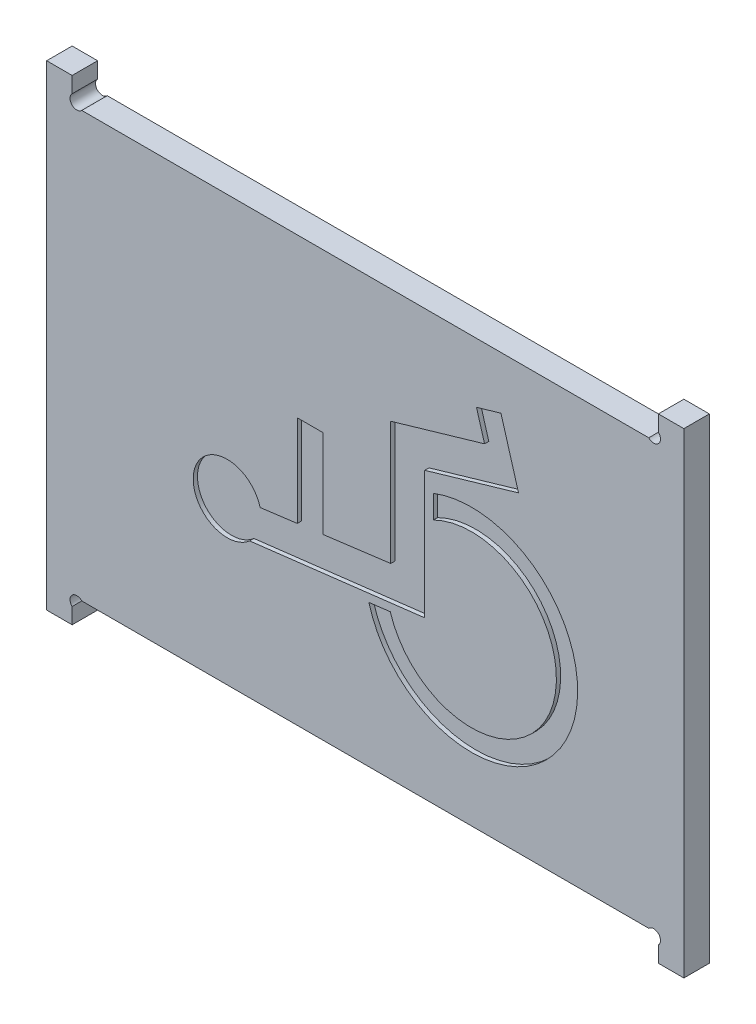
ISO-10303-21;
HEADER;
FILE_DESCRIPTION(('STEP AP214'),'2;1');
FILE_NAME('part.step','',(''),(''),'','','');
FILE_SCHEMA(('AUTOMOTIVE_DESIGN { 1 0 10303 214 1 1 1 1 }'));
ENDSEC;
DATA;
#1=APPLICATION_CONTEXT('core data for automotive mechanical design processes');
#2=APPLICATION_PROTOCOL_DEFINITION('international standard','automotive_design',2000,#1);
#3=PRODUCT_CONTEXT('',#1,'mechanical');
#4=PRODUCT('Part','Part','',(#3));
#5=PRODUCT_RELATED_PRODUCT_CATEGORY('part','',(#4));
#6=PRODUCT_DEFINITION_FORMATION('','',#4);
#7=PRODUCT_DEFINITION_CONTEXT('part definition',#1,'design');
#8=PRODUCT_DEFINITION('design','',#6,#7);
#9=PRODUCT_DEFINITION_SHAPE('','',#8);
#10=(LENGTH_UNIT() NAMED_UNIT(*) SI_UNIT(.MILLI.,.METRE.));
#11=(NAMED_UNIT(*) PLANE_ANGLE_UNIT() SI_UNIT($,.RADIAN.));
#12=(NAMED_UNIT(*) SI_UNIT($,.STERADIAN.) SOLID_ANGLE_UNIT());
#13=UNCERTAINTY_MEASURE_WITH_UNIT(LENGTH_MEASURE(1.E-05),#10,'distance_accuracy_value','');
#14=(GEOMETRIC_REPRESENTATION_CONTEXT(3) GLOBAL_UNCERTAINTY_ASSIGNED_CONTEXT((#13)) GLOBAL_UNIT_ASSIGNED_CONTEXT((#10,
#11,#12)) REPRESENTATION_CONTEXT('',''));
#15=CARTESIAN_POINT('',(0.,0.,0.));
#16=DIRECTION('',(0.,0.,1.));
#17=DIRECTION('',(1.,0.,0.));
#18=AXIS2_PLACEMENT_3D('',#15,#16,#17);
#19=CARTESIAN_POINT('',(-44.2409019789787,-70.5968781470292,6.));
#20=DIRECTION('',(1.,0.,0.));
#21=DIRECTION('',(0.,1.,0.));
#22=AXIS2_PLACEMENT_3D('',#19,#20,#21);
#23=PLANE('',#22);
#24=DIRECTION('',(0.,-1.,0.));
#25=VECTOR('',#24,1.);
#26=CARTESIAN_POINT('',(-44.2409019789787,-70.5968781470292,0.));
#27=LINE('',#26,#25);
#28=CARTESIAN_POINT('',(-44.2409019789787,35.4031218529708,0.));
#29=VERTEX_POINT('',#28);
#30=CARTESIAN_POINT('',(-44.2409019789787,-76.5968781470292,0.));
#31=VERTEX_POINT('',#30);
#32=EDGE_CURVE('E529',#29,#31,#27,.T.);
#33=ORIENTED_EDGE('',*,*,#32,.T.);
#34=DIRECTION('',(0.,0.,-1.));
#35=VECTOR('',#34,1.);
#36=CARTESIAN_POINT('',(-44.2409019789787,-76.5968781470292,6.));
#37=LINE('',#36,#35);
#38=CARTESIAN_POINT('',(-44.2409019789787,-76.5968781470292,6.));
#39=VERTEX_POINT('',#38);
#40=EDGE_CURVE('E327',#39,#31,#37,.T.);
#41=ORIENTED_EDGE('',*,*,#40,.F.);
#42=DIRECTION('',(0.,-1.,0.));
#43=VECTOR('',#42,1.);
#44=CARTESIAN_POINT('',(-44.2409019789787,29.4031218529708,6.));
#45=LINE('',#44,#43);
#46=CARTESIAN_POINT('',(-44.2409019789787,35.4031218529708,6.));
#47=VERTEX_POINT('',#46);
#48=EDGE_CURVE('E275',#47,#39,#45,.T.);
#49=ORIENTED_EDGE('',*,*,#48,.F.);
#50=DIRECTION('',(0.,0.,-1.));
#51=VECTOR('',#50,1.);
#52=CARTESIAN_POINT('',(-44.2409019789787,35.4031218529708,6.));
#53=LINE('',#52,#51);
#54=EDGE_CURVE('E307',#47,#29,#53,.T.);
#55=ORIENTED_EDGE('',*,*,#54,.T.);
#56=EDGE_LOOP('',(#33,#41,#49,#55));
#57=FACE_BOUND('',#56,.T.);
#58=ADVANCED_FACE('F34',(#57),#23,.F.);
#59=CARTESIAN_POINT('',(-44.2409019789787,-76.5968781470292,6.));
#60=DIRECTION('',(0.,1.,0.));
#61=DIRECTION('',(0.,0.,1.));
#62=AXIS2_PLACEMENT_3D('',#59,#60,#61);
#63=PLANE('',#62);
#64=DIRECTION('',(1.,0.,0.));
#65=VECTOR('',#64,1.);
#66=CARTESIAN_POINT('',(-44.2409019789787,-76.5968781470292,0.));
#67=LINE('',#66,#65);
#68=CARTESIAN_POINT('',(-38.2409019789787,-76.5968781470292,0.));
#69=VERTEX_POINT('',#68);
#70=EDGE_CURVE('E537',#31,#69,#67,.T.);
#71=ORIENTED_EDGE('',*,*,#70,.T.);
#72=DIRECTION('',(0.,0.,-1.));
#73=VECTOR('',#72,1.);
#74=CARTESIAN_POINT('',(-38.2409019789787,-76.5968781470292,6.));
#75=LINE('',#74,#73);
#76=CARTESIAN_POINT('',(-38.2409019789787,-76.5968781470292,6.));
#77=VERTEX_POINT('',#76);
#78=EDGE_CURVE('E324',#77,#69,#75,.T.);
#79=ORIENTED_EDGE('',*,*,#78,.F.);
#80=DIRECTION('',(1.,0.,0.));
#81=VECTOR('',#80,1.);
#82=CARTESIAN_POINT('',(-44.2409019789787,-76.5968781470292,6.));
#83=LINE('',#82,#81);
#84=EDGE_CURVE('E282',#39,#77,#83,.T.);
#85=ORIENTED_EDGE('',*,*,#84,.F.);
#86=ORIENTED_EDGE('',*,*,#40,.T.);
#87=EDGE_LOOP('',(#71,#79,#85,#86));
#88=FACE_BOUND('',#87,.T.);
#89=ADVANCED_FACE('F557',(#88),#63,.F.);
#90=CARTESIAN_POINT('',(-38.2409019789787,-76.5968781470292,6.));
#91=DIRECTION('',(-1.,0.,0.));
#92=DIRECTION('',(0.,0.,1.));
#93=AXIS2_PLACEMENT_3D('',#90,#91,#92);
#94=PLANE('',#93);
#95=DIRECTION('',(0.,1.,0.));
#96=VECTOR('',#95,1.);
#97=CARTESIAN_POINT('',(-38.2409019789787,-76.5968781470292,0.));
#98=LINE('',#97,#96);
#99=CARTESIAN_POINT('',(-38.2409019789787,-72.8587731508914,0.));
#100=VERTEX_POINT('',#99);
#101=EDGE_CURVE('E354',#69,#100,#98,.T.);
#102=ORIENTED_EDGE('',*,*,#101,.T.);
#103=DIRECTION('',(0.,0.,1.));
#104=VECTOR('',#103,1.);
#105=CARTESIAN_POINT('',(-38.2409019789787,-72.8587731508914,0.));
#106=LINE('',#105,#104);
#107=CARTESIAN_POINT('',(-38.2409019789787,-72.8587731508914,6.));
#108=VERTEX_POINT('',#107);
#109=EDGE_CURVE('E390',#100,#108,#106,.T.);
#110=ORIENTED_EDGE('',*,*,#109,.T.);
#111=DIRECTION('',(0.,1.,0.));
#112=VECTOR('',#111,1.);
#113=CARTESIAN_POINT('',(-38.2409019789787,-76.5968781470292,6.));
#114=LINE('',#113,#112);
#115=EDGE_CURVE('E284',#77,#108,#114,.T.);
#116=ORIENTED_EDGE('',*,*,#115,.F.);
#117=ORIENTED_EDGE('',*,*,#78,.T.);
#118=EDGE_LOOP('',(#102,#110,#116,#117));
#119=FACE_BOUND('',#118,.T.);
#120=ADVANCED_FACE('F541',(#119),#94,.F.);
#121=CARTESIAN_POINT('',(-38.2409019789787,-70.5968781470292,6.));
#122=DIRECTION('',(0.,1.,0.));
#123=DIRECTION('',(-1.,0.,0.));
#124=AXIS2_PLACEMENT_3D('',#121,#122,#123);
#125=PLANE('',#124);
#126=DIRECTION('',(1.,0.,0.));
#127=VECTOR('',#126,1.);
#128=CARTESIAN_POINT('',(-38.2409019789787,-70.5968781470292,0.));
#129=LINE('',#128,#127);
#130=CARTESIAN_POINT('',(-35.9790069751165,-70.5968781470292,0.));
#131=VERTEX_POINT('',#130);
#132=CARTESIAN_POINT('',(97.4972030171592,-70.5968781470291,0.));
#133=VERTEX_POINT('',#132);
#134=EDGE_CURVE('E350',#131,#133,#129,.T.);
#135=ORIENTED_EDGE('',*,*,#134,.T.);
#136=DIRECTION('',(0.,0.,1.));
#137=VECTOR('',#136,1.);
#138=CARTESIAN_POINT('',(97.4972030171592,-70.5968781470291,0.));
#139=LINE('',#138,#137);
#140=CARTESIAN_POINT('',(97.4972030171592,-70.5968781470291,6.));
#141=VERTEX_POINT('',#140);
#142=EDGE_CURVE('E336',#133,#141,#139,.T.);
#143=ORIENTED_EDGE('',*,*,#142,.T.);
#144=DIRECTION('',(1.,0.,0.));
#145=VECTOR('',#144,1.);
#146=CARTESIAN_POINT('',(-38.2409019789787,-70.5968781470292,6.));
#147=LINE('',#146,#145);
#148=CARTESIAN_POINT('',(-35.9790069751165,-70.5968781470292,6.));
#149=VERTEX_POINT('',#148);
#150=EDGE_CURVE('E287',#149,#141,#147,.T.);
#151=ORIENTED_EDGE('',*,*,#150,.F.);
#152=DIRECTION('',(0.,0.,1.));
#153=VECTOR('',#152,1.);
#154=CARTESIAN_POINT('',(-35.9790069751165,-70.5968781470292,0.));
#155=LINE('',#154,#153);
#156=EDGE_CURVE('E387',#149,#131,#155,.F.);
#157=ORIENTED_EDGE('',*,*,#156,.T.);
#158=EDGE_LOOP('',(#135,#143,#151,#157));
#159=FACE_BOUND('',#158,.T.);
#160=ADVANCED_FACE('F550',(#159),#125,.F.);
#161=CARTESIAN_POINT('',(99.7590980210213,-76.5968781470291,6.));
#162=DIRECTION('',(1.,0.,0.));
#163=DIRECTION('',(0.,1.,0.));
#164=AXIS2_PLACEMENT_3D('',#161,#162,#163);
#165=PLANE('',#164);
#166=DIRECTION('',(0.,-1.,0.));
#167=VECTOR('',#166,1.);
#168=CARTESIAN_POINT('',(99.7590980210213,-76.5968781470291,6.));
#169=LINE('',#168,#167);
#170=CARTESIAN_POINT('',(99.7590980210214,-72.8587731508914,6.));
#171=VERTEX_POINT('',#170);
#172=CARTESIAN_POINT('',(99.7590980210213,-76.5968781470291,6.));
#173=VERTEX_POINT('',#172);
#174=EDGE_CURVE('E290',#171,#173,#169,.T.);
#175=ORIENTED_EDGE('',*,*,#174,.F.);
#176=DIRECTION('',(0.,0.,1.));
#177=VECTOR('',#176,1.);
#178=CARTESIAN_POINT('',(99.7590980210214,-72.8587731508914,0.));
#179=LINE('',#178,#177);
#180=CARTESIAN_POINT('',(99.7590980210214,-72.8587731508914,0.));
#181=VERTEX_POINT('',#180);
#182=EDGE_CURVE('E333',#171,#181,#179,.F.);
#183=ORIENTED_EDGE('',*,*,#182,.T.);
#184=DIRECTION('',(0.,-1.,0.));
#185=VECTOR('',#184,1.);
#186=CARTESIAN_POINT('',(99.7590980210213,-76.5968781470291,0.));
#187=LINE('',#186,#185);
#188=CARTESIAN_POINT('',(99.7590980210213,-76.5968781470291,0.));
#189=VERTEX_POINT('',#188);
#190=EDGE_CURVE('E344',#181,#189,#187,.T.);
#191=ORIENTED_EDGE('',*,*,#190,.T.);
#192=DIRECTION('',(0.,0.,-1.));
#193=VECTOR('',#192,1.);
#194=CARTESIAN_POINT('',(99.7590980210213,-76.5968781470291,6.));
#195=LINE('',#194,#193);
#196=EDGE_CURVE('E321',#173,#189,#195,.T.);
#197=ORIENTED_EDGE('',*,*,#196,.F.);
#198=EDGE_LOOP('',(#175,#183,#191,#197));
#199=FACE_BOUND('',#198,.T.);
#200=ADVANCED_FACE('F342',(#199),#165,.F.);
#201=CARTESIAN_POINT('',(105.759098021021,-76.5968781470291,6.));
#202=DIRECTION('',(0.,1.,0.));
#203=DIRECTION('',(0.,0.,1.));
#204=AXIS2_PLACEMENT_3D('',#201,#202,#203);
#205=PLANE('',#204);
#206=DIRECTION('',(1.,0.,0.));
#207=VECTOR('',#206,1.);
#208=CARTESIAN_POINT('',(105.759098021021,-76.5968781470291,0.));
#209=LINE('',#208,#207);
#210=CARTESIAN_POINT('',(105.759098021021,-76.5968781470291,0.));
#211=VERTEX_POINT('',#210);
#212=EDGE_CURVE('E349',#189,#211,#209,.T.);
#213=ORIENTED_EDGE('',*,*,#212,.T.);
#214=DIRECTION('',(0.,0.,-1.));
#215=VECTOR('',#214,1.);
#216=CARTESIAN_POINT('',(105.759098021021,-76.5968781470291,6.));
#217=LINE('',#216,#215);
#218=CARTESIAN_POINT('',(105.759098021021,-76.5968781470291,6.));
#219=VERTEX_POINT('',#218);
#220=EDGE_CURVE('E318',#219,#211,#217,.T.);
#221=ORIENTED_EDGE('',*,*,#220,.F.);
#222=DIRECTION('',(1.,0.,0.));
#223=VECTOR('',#222,1.);
#224=CARTESIAN_POINT('',(105.759098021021,-76.5968781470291,6.));
#225=LINE('',#224,#223);
#226=EDGE_CURVE('E292',#173,#219,#225,.T.);
#227=ORIENTED_EDGE('',*,*,#226,.F.);
#228=ORIENTED_EDGE('',*,*,#196,.T.);
#229=EDGE_LOOP('',(#213,#221,#227,#228));
#230=FACE_BOUND('',#229,.T.);
#231=ADVANCED_FACE('F573',(#230),#205,.F.);
#232=CARTESIAN_POINT('',(105.759098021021,35.4031218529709,6.));
#233=DIRECTION('',(-1.,0.,0.));
#234=DIRECTION('',(0.,-1.,0.));
#235=AXIS2_PLACEMENT_3D('',#232,#233,#234);
#236=PLANE('',#235);
#237=DIRECTION('',(0.,1.,0.));
#238=VECTOR('',#237,1.);
#239=CARTESIAN_POINT('',(105.759098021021,35.4031218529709,0.));
#240=LINE('',#239,#238);
#241=CARTESIAN_POINT('',(105.759098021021,35.4031218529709,0.));
#242=VERTEX_POINT('',#241);
#243=EDGE_CURVE('E352',#211,#242,#240,.T.);
#244=ORIENTED_EDGE('',*,*,#243,.T.);
#245=DIRECTION('',(0.,0.,-1.));
#246=VECTOR('',#245,1.);
#247=CARTESIAN_POINT('',(105.759098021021,35.4031218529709,6.));
#248=LINE('',#247,#246);
#249=CARTESIAN_POINT('',(105.759098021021,35.4031218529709,6.));
#250=VERTEX_POINT('',#249);
#251=EDGE_CURVE('E315',#250,#242,#248,.T.);
#252=ORIENTED_EDGE('',*,*,#251,.F.);
#253=DIRECTION('',(0.,1.,0.));
#254=VECTOR('',#253,1.);
#255=CARTESIAN_POINT('',(105.759098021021,-70.5968781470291,6.));
#256=LINE('',#255,#254);
#257=EDGE_CURVE('E294',#219,#250,#256,.T.);
#258=ORIENTED_EDGE('',*,*,#257,.F.);
#259=ORIENTED_EDGE('',*,*,#220,.T.);
#260=EDGE_LOOP('',(#244,#252,#258,#259));
#261=FACE_BOUND('',#260,.T.);
#262=ADVANCED_FACE('F570',(#261),#236,.F.);
#263=CARTESIAN_POINT('',(99.7590980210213,35.4031218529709,6.));
#264=DIRECTION('',(0.,-1.,0.));
#265=DIRECTION('',(0.,0.,-1.));
#266=AXIS2_PLACEMENT_3D('',#263,#264,#265);
#267=PLANE('',#266);
#268=DIRECTION('',(-1.,0.,0.));
#269=VECTOR('',#268,1.);
#270=CARTESIAN_POINT('',(99.7590980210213,35.4031218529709,0.));
#271=LINE('',#270,#269);
#272=CARTESIAN_POINT('',(99.7590980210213,35.4031218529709,0.));
#273=VERTEX_POINT('',#272);
#274=EDGE_CURVE('E359',#242,#273,#271,.T.);
#275=ORIENTED_EDGE('',*,*,#274,.T.);
#276=DIRECTION('',(0.,0.,-1.));
#277=VECTOR('',#276,1.);
#278=CARTESIAN_POINT('',(99.7590980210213,35.4031218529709,6.));
#279=LINE('',#278,#277);
#280=CARTESIAN_POINT('',(99.7590980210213,35.4031218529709,6.));
#281=VERTEX_POINT('',#280);
#282=EDGE_CURVE('E312',#281,#273,#279,.T.);
#283=ORIENTED_EDGE('',*,*,#282,.F.);
#284=DIRECTION('',(-1.,0.,0.));
#285=VECTOR('',#284,1.);
#286=CARTESIAN_POINT('',(99.7590980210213,35.4031218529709,6.));
#287=LINE('',#286,#285);
#288=EDGE_CURVE('E296',#250,#281,#287,.T.);
#289=ORIENTED_EDGE('',*,*,#288,.F.);
#290=ORIENTED_EDGE('',*,*,#251,.T.);
#291=EDGE_LOOP('',(#275,#283,#289,#290));
#292=FACE_BOUND('',#291,.T.);
#293=ADVANCED_FACE('F568',(#292),#267,.F.);
#294=CARTESIAN_POINT('',(99.7590980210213,29.4031218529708,6.));
#295=DIRECTION('',(1.,0.,0.));
#296=DIRECTION('',(0.,1.,0.));
#297=AXIS2_PLACEMENT_3D('',#294,#295,#296);
#298=PLANE('',#297);
#299=DIRECTION('',(0.,-1.,0.));
#300=VECTOR('',#299,1.);
#301=CARTESIAN_POINT('',(99.7590980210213,29.4031218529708,0.));
#302=LINE('',#301,#300);
#303=CARTESIAN_POINT('',(99.7590980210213,31.665016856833,0.));
#304=VERTEX_POINT('',#303);
#305=EDGE_CURVE('E277',#273,#304,#302,.T.);
#306=ORIENTED_EDGE('',*,*,#305,.T.);
#307=DIRECTION('',(0.,0.,1.));
#308=VECTOR('',#307,1.);
#309=CARTESIAN_POINT('',(99.7590980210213,31.665016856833,0.));
#310=LINE('',#309,#308);
#311=CARTESIAN_POINT('',(99.7590980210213,31.665016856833,6.));
#312=VERTEX_POINT('',#311);
#313=EDGE_CURVE('E55',#304,#312,#310,.T.);
#314=ORIENTED_EDGE('',*,*,#313,.T.);
#315=DIRECTION('',(0.,-1.,0.));
#316=VECTOR('',#315,1.);
#317=CARTESIAN_POINT('',(99.7590980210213,29.4031218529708,6.));
#318=LINE('',#317,#316);
#319=EDGE_CURVE('E298',#281,#312,#318,.T.);
#320=ORIENTED_EDGE('',*,*,#319,.F.);
#321=ORIENTED_EDGE('',*,*,#282,.T.);
#322=EDGE_LOOP('',(#306,#314,#320,#321));
#323=FACE_BOUND('',#322,.T.);
#324=ADVANCED_FACE('F363',(#323),#298,.F.);
#325=CARTESIAN_POINT('',(-38.2409019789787,29.4031218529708,6.));
#326=DIRECTION('',(0.,-1.,0.));
#327=DIRECTION('',(1.,0.,0.));
#328=AXIS2_PLACEMENT_3D('',#325,#326,#327);
#329=PLANE('',#328);
#330=DIRECTION('',(-1.,0.,0.));
#331=VECTOR('',#330,1.);
#332=CARTESIAN_POINT('',(-38.2409019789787,29.4031218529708,0.));
#333=LINE('',#332,#331);
#334=CARTESIAN_POINT('',(97.4972030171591,29.4031218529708,0.));
#335=VERTEX_POINT('',#334);
#336=CARTESIAN_POINT('',(-35.9790069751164,29.4031218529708,0.));
#337=VERTEX_POINT('',#336);
#338=EDGE_CURVE('E273',#335,#337,#333,.T.);
#339=ORIENTED_EDGE('',*,*,#338,.T.);
#340=DIRECTION('',(0.,0.,1.));
#341=VECTOR('',#340,1.);
#342=CARTESIAN_POINT('',(-35.9790069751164,29.4031218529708,0.));
#343=LINE('',#342,#341);
#344=CARTESIAN_POINT('',(-35.9790069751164,29.4031218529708,6.));
#345=VERTEX_POINT('',#344);
#346=EDGE_CURVE('E48',#337,#345,#343,.T.);
#347=ORIENTED_EDGE('',*,*,#346,.T.);
#348=DIRECTION('',(-1.,0.,0.));
#349=VECTOR('',#348,1.);
#350=CARTESIAN_POINT('',(-38.2409019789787,29.4031218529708,6.));
#351=LINE('',#350,#349);
#352=CARTESIAN_POINT('',(97.4972030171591,29.4031218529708,6.));
#353=VERTEX_POINT('',#352);
#354=EDGE_CURVE('E301',#353,#345,#351,.T.);
#355=ORIENTED_EDGE('',*,*,#354,.F.);
#356=DIRECTION('',(0.,0.,1.));
#357=VECTOR('',#356,1.);
#358=CARTESIAN_POINT('',(97.4972030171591,29.4031218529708,0.));
#359=LINE('',#358,#357);
#360=EDGE_CURVE('E369',#353,#335,#359,.F.);
#361=ORIENTED_EDGE('',*,*,#360,.T.);
#362=EDGE_LOOP('',(#339,#347,#355,#361));
#363=FACE_BOUND('',#362,.T.);
#364=ADVANCED_FACE('F373',(#363),#329,.F.);
#365=CARTESIAN_POINT('',(-38.2409019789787,35.4031218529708,6.));
#366=DIRECTION('',(-1.,0.,0.));
#367=DIRECTION('',(0.,-1.,0.));
#368=AXIS2_PLACEMENT_3D('',#365,#366,#367);
#369=PLANE('',#368);
#370=DIRECTION('',(0.,1.,0.));
#371=VECTOR('',#370,1.);
#372=CARTESIAN_POINT('',(-38.2409019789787,35.4031218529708,6.));
#373=LINE('',#372,#371);
#374=CARTESIAN_POINT('',(-38.2409019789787,31.665016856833,6.));
#375=VERTEX_POINT('',#374);
#376=CARTESIAN_POINT('',(-38.2409019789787,35.4031218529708,6.));
#377=VERTEX_POINT('',#376);
#378=EDGE_CURVE('E267',#375,#377,#373,.T.);
#379=ORIENTED_EDGE('',*,*,#378,.F.);
#380=DIRECTION('',(0.,0.,1.));
#381=VECTOR('',#380,1.);
#382=CARTESIAN_POINT('',(-38.2409019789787,31.665016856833,0.));
#383=LINE('',#382,#381);
#384=CARTESIAN_POINT('',(-38.2409019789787,31.665016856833,0.));
#385=VERTEX_POINT('',#384);
#386=EDGE_CURVE('E253',#375,#385,#383,.F.);
#387=ORIENTED_EDGE('',*,*,#386,.T.);
#388=DIRECTION('',(0.,1.,0.));
#389=VECTOR('',#388,1.);
#390=CARTESIAN_POINT('',(-38.2409019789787,35.4031218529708,0.));
#391=LINE('',#390,#389);
#392=CARTESIAN_POINT('',(-38.2409019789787,35.4031218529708,0.));
#393=VERTEX_POINT('',#392);
#394=EDGE_CURVE('E265',#385,#393,#391,.T.);
#395=ORIENTED_EDGE('',*,*,#394,.T.);
#396=DIRECTION('',(0.,0.,-1.));
#397=VECTOR('',#396,1.);
#398=CARTESIAN_POINT('',(-38.2409019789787,35.4031218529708,6.));
#399=LINE('',#398,#397);
#400=EDGE_CURVE('E310',#377,#393,#399,.T.);
#401=ORIENTED_EDGE('',*,*,#400,.F.);
#402=EDGE_LOOP('',(#379,#387,#395,#401));
#403=FACE_BOUND('',#402,.T.);
#404=ADVANCED_FACE('F263',(#403),#369,.F.);
#405=CARTESIAN_POINT('',(-44.2409019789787,35.4031218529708,6.));
#406=DIRECTION('',(0.,-1.,0.));
#407=DIRECTION('',(1.,0.,0.));
#408=AXIS2_PLACEMENT_3D('',#405,#406,#407);
#409=PLANE('',#408);
#410=DIRECTION('',(-1.,0.,0.));
#411=VECTOR('',#410,1.);
#412=CARTESIAN_POINT('',(-44.2409019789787,35.4031218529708,0.));
#413=LINE('',#412,#411);
#414=EDGE_CURVE('E272',#393,#29,#413,.T.);
#415=ORIENTED_EDGE('',*,*,#414,.T.);
#416=ORIENTED_EDGE('',*,*,#54,.F.);
#417=DIRECTION('',(-1.,0.,0.));
#418=VECTOR('',#417,1.);
#419=CARTESIAN_POINT('',(-44.2409019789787,35.4031218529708,6.));
#420=LINE('',#419,#418);
#421=EDGE_CURVE('E305',#377,#47,#420,.T.);
#422=ORIENTED_EDGE('',*,*,#421,.F.);
#423=ORIENTED_EDGE('',*,*,#400,.T.);
#424=EDGE_LOOP('',(#415,#416,#422,#423));
#425=FACE_BOUND('',#424,.T.);
#426=ADVANCED_FACE('F561',(#425),#409,.F.);
#427=CARTESIAN_POINT('',(-44.2409019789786,-70.5968781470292,6.));
#428=DIRECTION('',(0.,0.,-1.));
#429=DIRECTION('',(-1.,0.,0.));
#430=AXIS2_PLACEMENT_3D('',#427,#428,#429);
#431=PLANE('',#430);
#432=DIRECTION('',(0.,1.,0.));
#433=VECTOR('',#432,1.);
#434=CARTESIAN_POINT('',(44.7590980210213,-11.2319614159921,6.));
#435=LINE('',#434,#433);
#436=CARTESIAN_POINT('',(44.7590980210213,-33.6710207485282,6.));
#437=VERTEX_POINT('',#436);
#438=CARTESIAN_POINT('',(44.7590980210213,-3.59687814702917,6.));
#439=VERTEX_POINT('',#438);
#440=EDGE_CURVE('E393',#437,#439,#435,.T.);
#441=ORIENTED_EDGE('',*,*,#440,.F.);
#442=DIRECTION('',(0.992931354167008,0.118690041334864,0.));
#443=VECTOR('',#442,1.);
#444=CARTESIAN_POINT('',(3.55060064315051,-38.5968781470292,6.));
#445=LINE('',#444,#443);
#446=CARTESIAN_POINT('',(3.55060064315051,-38.5968781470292,6.));
#447=VERTEX_POINT('',#446);
#448=EDGE_CURVE('E432',#447,#437,#445,.T.);
#449=ORIENTED_EDGE('',*,*,#448,.F.);
#450=CARTESIAN_POINT('',(-1.74090197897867,-32.5968781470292,6.));
#451=DIRECTION('',(0.,0.,1.));
#452=DIRECTION('',(1.,0.,0.));
#453=AXIS2_PLACEMENT_3D('',#450,#451,#452);
#454=CIRCLE('',#453,8.);
#455=CARTESIAN_POINT('',(5.99504265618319,-30.5584570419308,6.));
#456=VERTEX_POINT('',#455);
#457=EDGE_CURVE('E429',#456,#447,#454,.T.);
#458=ORIENTED_EDGE('',*,*,#457,.F.);
#459=DIRECTION('',(-0.991810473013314,-0.127718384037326,0.));
#460=VECTOR('',#459,1.);
#461=CARTESIAN_POINT('',(5.99504265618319,-30.5584570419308,6.));
#462=LINE('',#461,#460);
#463=CARTESIAN_POINT('',(14.7590980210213,-29.429883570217,6.));
#464=VERTEX_POINT('',#463);
#465=EDGE_CURVE('E426',#464,#456,#462,.T.);
#466=ORIENTED_EDGE('',*,*,#465,.F.);
#467=DIRECTION('',(0.,-1.,0.));
#468=VECTOR('',#467,1.);
#469=CARTESIAN_POINT('',(14.7590980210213,-29.429883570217,6.));
#470=LINE('',#469,#468);
#471=CARTESIAN_POINT('',(14.7590980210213,-7.88918583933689,6.));
#472=VERTEX_POINT('',#471);
#473=EDGE_CURVE('E423',#472,#464,#470,.T.);
#474=ORIENTED_EDGE('',*,*,#473,.F.);
#475=DIRECTION('',(-1.,0.,0.));
#476=VECTOR('',#475,1.);
#477=CARTESIAN_POINT('',(14.7590980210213,-7.88918583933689,6.));
#478=LINE('',#477,#476);
#479=CARTESIAN_POINT('',(20.7590980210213,-7.88918583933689,6.));
#480=VERTEX_POINT('',#479);
#481=EDGE_CURVE('E420',#480,#472,#478,.T.);
#482=ORIENTED_EDGE('',*,*,#481,.F.);
#483=DIRECTION('',(0.,1.,0.));
#484=VECTOR('',#483,1.);
#485=CARTESIAN_POINT('',(20.7590980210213,-28.6572457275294,6.));
#486=LINE('',#485,#484);
#487=CARTESIAN_POINT('',(20.7590980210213,-28.6572457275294,6.));
#488=VERTEX_POINT('',#487);
#489=EDGE_CURVE('E417',#488,#480,#486,.T.);
#490=ORIENTED_EDGE('',*,*,#489,.F.);
#491=DIRECTION('',(-0.991810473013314,-0.127718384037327,0.));
#492=VECTOR('',#491,1.);
#493=CARTESIAN_POINT('',(20.7590980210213,-28.6572457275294,6.));
#494=LINE('',#493,#492);
#495=CARTESIAN_POINT('',(36.7590980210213,-26.5968781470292,6.));
#496=VERTEX_POINT('',#495);
#497=EDGE_CURVE('E414',#496,#488,#494,.T.);
#498=ORIENTED_EDGE('',*,*,#497,.F.);
#499=DIRECTION('',(0.,-1.,0.));
#500=VECTOR('',#499,1.);
#501=CARTESIAN_POINT('',(36.7590980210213,-26.5968781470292,6.));
#502=LINE('',#501,#500);
#503=CARTESIAN_POINT('',(36.7590980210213,2.40312185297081,6.));
#504=VERTEX_POINT('',#503);
#505=EDGE_CURVE('E411',#504,#496,#502,.T.);
#506=ORIENTED_EDGE('',*,*,#505,.F.);
#507=DIRECTION('',(-0.959999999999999,-0.280000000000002,0.));
#508=VECTOR('',#507,1.);
#509=CARTESIAN_POINT('',(58.8390980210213,8.84312185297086,6.));
#510=LINE('',#509,#508);
#511=CARTESIAN_POINT('',(58.8390980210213,8.84312185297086,6.));
#512=VERTEX_POINT('',#511);
#513=EDGE_CURVE('E408',#512,#504,#510,.T.);
#514=ORIENTED_EDGE('',*,*,#513,.F.);
#515=DIRECTION('',(0.280000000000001,-0.96,0.));
#516=VECTOR('',#515,1.);
#517=CARTESIAN_POINT('',(56.944505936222,15.3388661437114,6.));
#518=LINE('',#517,#516);
#519=CARTESIAN_POINT('',(56.944505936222,15.3388661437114,6.));
#520=VERTEX_POINT('',#519);
#521=EDGE_CURVE('E405',#520,#512,#518,.T.);
#522=ORIENTED_EDGE('',*,*,#521,.F.);
#523=DIRECTION('',(-0.96,-0.280000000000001,0.));
#524=VECTOR('',#523,1.);
#525=CARTESIAN_POINT('',(62.704505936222,17.0188661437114,6.));
#526=LINE('',#525,#524);
#527=CARTESIAN_POINT('',(62.704505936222,17.0188661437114,6.));
#528=VERTEX_POINT('',#527);
#529=EDGE_CURVE('E402',#528,#520,#526,.T.);
#530=ORIENTED_EDGE('',*,*,#529,.F.);
#531=DIRECTION('',(-0.280000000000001,0.96,0.));
#532=VECTOR('',#531,1.);
#533=CARTESIAN_POINT('',(66.8390980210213,2.84312185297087,6.));
#534=LINE('',#533,#532);
#535=CARTESIAN_POINT('',(66.8390980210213,2.84312185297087,6.));
#536=VERTEX_POINT('',#535);
#537=EDGE_CURVE('E399',#536,#528,#534,.T.);
#538=ORIENTED_EDGE('',*,*,#537,.F.);
#539=DIRECTION('',(0.96,0.280000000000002,0.));
#540=VECTOR('',#539,1.);
#541=CARTESIAN_POINT('',(44.7590980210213,-3.59687814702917,6.));
#542=LINE('',#541,#540);
#543=EDGE_CURVE('E396',#439,#536,#542,.T.);
#544=ORIENTED_EDGE('',*,*,#543,.F.);
#545=EDGE_LOOP('',(#441,#449,#458,#466,#474,#482,#490,#498,#506,#514,#522,#530,#538,#544));
#546=FACE_BOUND('',#545,.T.);
#547=DIRECTION('',(0.,-1.,0.));
#548=VECTOR('',#547,1.);
#549=CARTESIAN_POINT('',(46.7733063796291,-12.7291544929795,6.));
#550=LINE('',#549,#548);
#551=CARTESIAN_POINT('',(46.7733063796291,-7.26759293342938,6.));
#552=VERTEX_POINT('',#551);
#553=CARTESIAN_POINT('',(46.7733063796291,-12.7291544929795,6.));
#554=VERTEX_POINT('',#553);
#555=EDGE_CURVE('E505',#552,#554,#550,.T.);
#556=ORIENTED_EDGE('',*,*,#555,.F.);
#557=CARTESIAN_POINT('',(55.7590980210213,-30.5968781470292,6.));
#558=DIRECTION('',(0.,0.,1.));
#559=DIRECTION('',(1.,0.,0.));
#560=AXIS2_PLACEMENT_3D('',#557,#558,#559);
#561=CIRCLE('',#560,25.);
#562=CARTESIAN_POINT('',(31.6202901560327,-37.1021033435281,6.));
#563=VERTEX_POINT('',#562);
#564=EDGE_CURVE('E478',#563,#552,#561,.T.);
#565=ORIENTED_EDGE('',*,*,#564,.F.);
#566=DIRECTION('',(-0.992389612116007,-0.123137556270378,0.));
#567=VECTOR('',#566,1.);
#568=CARTESIAN_POINT('',(31.6202901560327,-37.1021033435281,6.));
#569=LINE('',#568,#567);
#570=CARTESIAN_POINT('',(36.6435820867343,-36.4788039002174,6.));
#571=VERTEX_POINT('',#570);
#572=EDGE_CURVE('E511',#571,#563,#569,.T.);
#573=ORIENTED_EDGE('',*,*,#572,.F.);
#574=CARTESIAN_POINT('',(55.7590980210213,-30.5968781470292,6.));
#575=DIRECTION('',(0.,0.,-1.));
#576=DIRECTION('',(1.,0.,0.));
#577=AXIS2_PLACEMENT_3D('',#574,#575,#576);
#578=CIRCLE('',#577,20.);
#579=EDGE_CURVE('E508',#554,#571,#578,.T.);
#580=ORIENTED_EDGE('',*,*,#579,.F.);
#581=EDGE_LOOP('',(#556,#565,#573,#580));
#582=FACE_BOUND('',#581,.T.);
#583=ORIENTED_EDGE('',*,*,#354,.T.);
#584=CARTESIAN_POINT('',(-37.1409019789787,30.5031218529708,6.));
#585=DIRECTION('',(0.,0.,1.));
#586=DIRECTION('',(1.,0.,0.));
#587=AXIS2_PLACEMENT_3D('',#584,#585,#586);
#588=CIRCLE('',#587,1.6);
#589=EDGE_CURVE('E259',#375,#345,#588,.T.);
#590=ORIENTED_EDGE('',*,*,#589,.F.);
#591=ORIENTED_EDGE('',*,*,#378,.T.);
#592=ORIENTED_EDGE('',*,*,#421,.T.);
#593=ORIENTED_EDGE('',*,*,#48,.T.);
#594=ORIENTED_EDGE('',*,*,#84,.T.);
#595=ORIENTED_EDGE('',*,*,#115,.T.);
#596=CARTESIAN_POINT('',(-37.1409019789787,-71.6968781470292,6.));
#597=DIRECTION('',(0.,0.,1.));
#598=DIRECTION('',(1.,0.,0.));
#599=AXIS2_PLACEMENT_3D('',#596,#597,#598);
#600=CIRCLE('',#599,1.6);
#601=EDGE_CURVE('E382',#149,#108,#600,.T.);
#602=ORIENTED_EDGE('',*,*,#601,.F.);
#603=ORIENTED_EDGE('',*,*,#150,.T.);
#604=CARTESIAN_POINT('',(98.6590980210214,-71.6968781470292,6.));
#605=DIRECTION('',(0.,0.,1.));
#606=DIRECTION('',(1.,0.,0.));
#607=AXIS2_PLACEMENT_3D('',#604,#605,#606);
#608=CIRCLE('',#607,1.60000000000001);
#609=EDGE_CURVE('E345',#171,#141,#608,.T.);
#610=ORIENTED_EDGE('',*,*,#609,.F.);
#611=ORIENTED_EDGE('',*,*,#174,.T.);
#612=ORIENTED_EDGE('',*,*,#226,.T.);
#613=ORIENTED_EDGE('',*,*,#257,.T.);
#614=ORIENTED_EDGE('',*,*,#288,.T.);
#615=ORIENTED_EDGE('',*,*,#319,.T.);
#616=CARTESIAN_POINT('',(98.6590980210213,30.5031218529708,6.));
#617=DIRECTION('',(0.,0.,1.));
#618=DIRECTION('',(1.,0.,0.));
#619=AXIS2_PLACEMENT_3D('',#616,#617,#618);
#620=CIRCLE('',#619,1.6);
#621=EDGE_CURVE('E374',#353,#312,#620,.T.);
#622=ORIENTED_EDGE('',*,*,#621,.F.);
#623=EDGE_LOOP('',(#583,#590,#591,#592,#593,#594,#595,#602,#603,#610,#611,#612,#613,#614,#615,#622));
#624=FACE_BOUND('',#623,.T.);
#625=ADVANCED_FACE('F552',(#546,#582,#624),#431,.F.);
#626=CARTESIAN_POINT('',(-44.2409019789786,-70.5968781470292,0.));
#627=DIRECTION('',(0.,0.,-1.));
#628=DIRECTION('',(-1.,0.,0.));
#629=AXIS2_PLACEMENT_3D('',#626,#627,#628);
#630=PLANE('',#629);
#631=CARTESIAN_POINT('',(-37.1409019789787,30.5031218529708,0.));
#632=DIRECTION('',(0.,0.,1.));
#633=DIRECTION('',(1.,0.,0.));
#634=AXIS2_PLACEMENT_3D('',#631,#632,#633);
#635=CIRCLE('',#634,1.6);
#636=EDGE_CURVE('E250',#385,#337,#635,.T.);
#637=ORIENTED_EDGE('',*,*,#636,.T.);
#638=ORIENTED_EDGE('',*,*,#338,.F.);
#639=CARTESIAN_POINT('',(98.6590980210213,30.5031218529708,0.));
#640=DIRECTION('',(0.,0.,-1.));
#641=DIRECTION('',(-1.,0.,0.));
#642=AXIS2_PLACEMENT_3D('',#639,#640,#641);
#643=CIRCLE('',#642,1.6);
#644=EDGE_CURVE('E11',#304,#335,#643,.T.);
#645=ORIENTED_EDGE('',*,*,#644,.F.);
#646=ORIENTED_EDGE('',*,*,#305,.F.);
#647=ORIENTED_EDGE('',*,*,#274,.F.);
#648=ORIENTED_EDGE('',*,*,#243,.F.);
#649=ORIENTED_EDGE('',*,*,#212,.F.);
#650=ORIENTED_EDGE('',*,*,#190,.F.);
#651=CARTESIAN_POINT('',(98.6590980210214,-71.6968781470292,0.));
#652=DIRECTION('',(0.,0.,-1.));
#653=DIRECTION('',(-1.,0.,0.));
#654=AXIS2_PLACEMENT_3D('',#651,#652,#653);
#655=CIRCLE('',#654,1.60000000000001);
#656=EDGE_CURVE('E41',#133,#181,#655,.T.);
#657=ORIENTED_EDGE('',*,*,#656,.F.);
#658=ORIENTED_EDGE('',*,*,#134,.F.);
#659=CARTESIAN_POINT('',(-37.1409019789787,-71.6968781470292,0.));
#660=DIRECTION('',(0.,0.,1.));
#661=DIRECTION('',(1.,0.,0.));
#662=AXIS2_PLACEMENT_3D('',#659,#660,#661);
#663=CIRCLE('',#662,1.6);
#664=EDGE_CURVE('E384',#131,#100,#663,.T.);
#665=ORIENTED_EDGE('',*,*,#664,.T.);
#666=ORIENTED_EDGE('',*,*,#101,.F.);
#667=ORIENTED_EDGE('',*,*,#70,.F.);
#668=ORIENTED_EDGE('',*,*,#32,.F.);
#669=ORIENTED_EDGE('',*,*,#414,.F.);
#670=ORIENTED_EDGE('',*,*,#394,.F.);
#671=EDGE_LOOP('',(#637,#638,#645,#646,#647,#648,#649,#650,#657,#658,#665,#666,#667,#668,#669,#670));
#672=FACE_BOUND('',#671,.T.);
#673=ADVANCED_FACE('F270',(#672),#630,.T.);
#674=CARTESIAN_POINT('',(55.7590980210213,-30.5968781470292,5.));
#675=DIRECTION('',(0.,0.,1.));
#676=DIRECTION('',(1.,0.,0.));
#677=AXIS2_PLACEMENT_3D('',#674,#675,#676);
#678=CYLINDRICAL_SURFACE('',#677,25.);
#679=ORIENTED_EDGE('',*,*,#564,.T.);
#680=DIRECTION('',(0.,0.,1.));
#681=VECTOR('',#680,1.);
#682=CARTESIAN_POINT('',(46.7733063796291,-7.26759293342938,5.));
#683=LINE('',#682,#681);
#684=CARTESIAN_POINT('',(46.7733063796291,-7.26759293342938,5.));
#685=VERTEX_POINT('',#684);
#686=EDGE_CURVE('E526',#685,#552,#683,.T.);
#687=ORIENTED_EDGE('',*,*,#686,.F.);
#688=CARTESIAN_POINT('',(55.7590980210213,-30.5968781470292,5.));
#689=DIRECTION('',(0.,0.,1.));
#690=DIRECTION('',(1.,0.,0.));
#691=AXIS2_PLACEMENT_3D('',#688,#689,#690);
#692=CIRCLE('',#691,25.);
#693=CARTESIAN_POINT('',(31.6202901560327,-37.1021033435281,5.));
#694=VERTEX_POINT('',#693);
#695=EDGE_CURVE('E514',#694,#685,#692,.T.);
#696=ORIENTED_EDGE('',*,*,#695,.F.);
#697=DIRECTION('',(0.,0.,1.));
#698=VECTOR('',#697,1.);
#699=CARTESIAN_POINT('',(31.6202901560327,-37.1021033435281,5.));
#700=LINE('',#699,#698);
#701=EDGE_CURVE('E527',#694,#563,#700,.T.);
#702=ORIENTED_EDGE('',*,*,#701,.T.);
#703=EDGE_LOOP('',(#679,#687,#696,#702));
#704=FACE_BOUND('',#703,.T.);
#705=ADVANCED_FACE('F654',(#704),#678,.F.);
#706=CARTESIAN_POINT('',(31.6202901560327,-37.1021033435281,5.));
#707=DIRECTION('',(-0.123137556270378,0.992389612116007,0.));
#708=DIRECTION('',(-0.992389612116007,-0.123137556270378,0.));
#709=AXIS2_PLACEMENT_3D('',#706,#707,#708);
#710=PLANE('',#709);
#711=ORIENTED_EDGE('',*,*,#572,.T.);
#712=ORIENTED_EDGE('',*,*,#701,.F.);
#713=DIRECTION('',(-0.992389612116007,-0.123137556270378,0.));
#714=VECTOR('',#713,1.);
#715=CARTESIAN_POINT('',(31.6202901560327,-37.1021033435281,5.));
#716=LINE('',#715,#714);
#717=CARTESIAN_POINT('',(36.6435820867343,-36.4788039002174,5.));
#718=VERTEX_POINT('',#717);
#719=EDGE_CURVE('E523',#718,#694,#716,.T.);
#720=ORIENTED_EDGE('',*,*,#719,.F.);
#721=DIRECTION('',(0.,0.,1.));
#722=VECTOR('',#721,1.);
#723=CARTESIAN_POINT('',(36.6435820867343,-36.4788039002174,5.));
#724=LINE('',#723,#722);
#725=EDGE_CURVE('E530',#718,#571,#724,.T.);
#726=ORIENTED_EDGE('',*,*,#725,.T.);
#727=EDGE_LOOP('',(#711,#712,#720,#726));
#728=FACE_BOUND('',#727,.T.);
#729=ADVANCED_FACE('F758',(#728),#710,.F.);
#730=CARTESIAN_POINT('',(55.7590980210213,-30.5968781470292,5.));
#731=DIRECTION('',(0.,0.,1.));
#732=DIRECTION('',(1.,0.,0.));
#733=AXIS2_PLACEMENT_3D('',#730,#731,#732);
#734=CYLINDRICAL_SURFACE('',#733,20.);
#735=ORIENTED_EDGE('',*,*,#579,.T.);
#736=ORIENTED_EDGE('',*,*,#725,.F.);
#737=CARTESIAN_POINT('',(55.7590980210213,-30.5968781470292,5.));
#738=DIRECTION('',(0.,0.,-1.));
#739=DIRECTION('',(1.,0.,0.));
#740=AXIS2_PLACEMENT_3D('',#737,#738,#739);
#741=CIRCLE('',#740,20.);
#742=CARTESIAN_POINT('',(46.7733063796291,-12.7291544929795,5.));
#743=VERTEX_POINT('',#742);
#744=EDGE_CURVE('E520',#743,#718,#741,.T.);
#745=ORIENTED_EDGE('',*,*,#744,.F.);
#746=DIRECTION('',(0.,0.,1.));
#747=VECTOR('',#746,1.);
#748=CARTESIAN_POINT('',(46.7733063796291,-12.7291544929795,5.));
#749=LINE('',#748,#747);
#750=EDGE_CURVE('E532',#743,#554,#749,.T.);
#751=ORIENTED_EDGE('',*,*,#750,.T.);
#752=EDGE_LOOP('',(#735,#736,#745,#751));
#753=FACE_BOUND('',#752,.T.);
#754=ADVANCED_FACE('F761',(#753),#734,.T.);
#755=CARTESIAN_POINT('',(46.7733063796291,-12.7291544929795,5.));
#756=DIRECTION('',(-1.,0.,0.));
#757=DIRECTION('',(0.,-1.,0.));
#758=AXIS2_PLACEMENT_3D('',#755,#756,#757);
#759=PLANE('',#758);
#760=ORIENTED_EDGE('',*,*,#555,.T.);
#761=ORIENTED_EDGE('',*,*,#750,.F.);
#762=DIRECTION('',(0.,-1.,0.));
#763=VECTOR('',#762,1.);
#764=CARTESIAN_POINT('',(46.7733063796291,-12.7291544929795,5.));
#765=LINE('',#764,#763);
#766=EDGE_CURVE('E517',#685,#743,#765,.T.);
#767=ORIENTED_EDGE('',*,*,#766,.F.);
#768=ORIENTED_EDGE('',*,*,#686,.T.);
#769=EDGE_LOOP('',(#760,#761,#767,#768));
#770=FACE_BOUND('',#769,.T.);
#771=ADVANCED_FACE('F756',(#770),#759,.F.);
#772=CARTESIAN_POINT('',(55.7590980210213,-30.5968781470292,5.));
#773=DIRECTION('',(0.,0.,1.));
#774=DIRECTION('',(1.,0.,0.));
#775=AXIS2_PLACEMENT_3D('',#772,#773,#774);
#776=PLANE('',#775);
#777=ORIENTED_EDGE('',*,*,#695,.T.);
#778=ORIENTED_EDGE('',*,*,#766,.T.);
#779=ORIENTED_EDGE('',*,*,#744,.T.);
#780=ORIENTED_EDGE('',*,*,#719,.T.);
#781=EDGE_LOOP('',(#777,#778,#779,#780));
#782=FACE_BOUND('',#781,.T.);
#783=ADVANCED_FACE('F702',(#782),#776,.T.);
#784=CARTESIAN_POINT('',(3.55060064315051,-38.5968781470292,5.));
#785=DIRECTION('',(0.118690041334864,-0.992931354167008,0.));
#786=DIRECTION('',(0.992931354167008,0.118690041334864,0.));
#787=AXIS2_PLACEMENT_3D('',#784,#785,#786);
#788=PLANE('',#787);
#789=ORIENTED_EDGE('',*,*,#448,.T.);
#790=DIRECTION('',(0.,0.,1.));
#791=VECTOR('',#790,1.);
#792=CARTESIAN_POINT('',(44.7590980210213,-33.6710207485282,5.));
#793=LINE('',#792,#791);
#794=CARTESIAN_POINT('',(44.7590980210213,-33.6710207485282,5.));
#795=VERTEX_POINT('',#794);
#796=EDGE_CURVE('E475',#795,#437,#793,.T.);
#797=ORIENTED_EDGE('',*,*,#796,.F.);
#798=DIRECTION('',(0.992931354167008,0.118690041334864,0.));
#799=VECTOR('',#798,1.);
#800=CARTESIAN_POINT('',(3.55060064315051,-38.5968781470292,5.));
#801=LINE('',#800,#799);
#802=CARTESIAN_POINT('',(3.55060064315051,-38.5968781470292,5.));
#803=VERTEX_POINT('',#802);
#804=EDGE_CURVE('E471',#803,#795,#801,.T.);
#805=ORIENTED_EDGE('',*,*,#804,.F.);
#806=DIRECTION('',(0.,0.,1.));
#807=VECTOR('',#806,1.);
#808=CARTESIAN_POINT('',(3.55060064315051,-38.5968781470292,5.));
#809=LINE('',#808,#807);
#810=EDGE_CURVE('E479',#803,#447,#809,.T.);
#811=ORIENTED_EDGE('',*,*,#810,.T.);
#812=EDGE_LOOP('',(#789,#797,#805,#811));
#813=FACE_BOUND('',#812,.T.);
#814=ADVANCED_FACE('F698',(#813),#788,.F.);
#815=CARTESIAN_POINT('',(-1.74090197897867,-32.5968781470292,5.));
#816=DIRECTION('',(0.,0.,1.));
#817=DIRECTION('',(1.,0.,0.));
#818=AXIS2_PLACEMENT_3D('',#815,#816,#817);
#819=CYLINDRICAL_SURFACE('',#818,8.);
#820=ORIENTED_EDGE('',*,*,#457,.T.);
#821=ORIENTED_EDGE('',*,*,#810,.F.);
#822=CARTESIAN_POINT('',(-1.74090197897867,-32.5968781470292,5.));
#823=DIRECTION('',(0.,0.,1.));
#824=DIRECTION('',(1.,0.,0.));
#825=AXIS2_PLACEMENT_3D('',#822,#823,#824);
#826=CIRCLE('',#825,8.);
#827=CARTESIAN_POINT('',(5.99504265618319,-30.5584570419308,5.));
#828=VERTEX_POINT('',#827);
#829=EDGE_CURVE('E468',#828,#803,#826,.T.);
#830=ORIENTED_EDGE('',*,*,#829,.F.);
#831=DIRECTION('',(0.,0.,1.));
#832=VECTOR('',#831,1.);
#833=CARTESIAN_POINT('',(5.99504265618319,-30.5584570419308,5.));
#834=LINE('',#833,#832);
#835=EDGE_CURVE('E481',#828,#456,#834,.T.);
#836=ORIENTED_EDGE('',*,*,#835,.T.);
#837=EDGE_LOOP('',(#820,#821,#830,#836));
#838=FACE_BOUND('',#837,.T.);
#839=ADVANCED_FACE('F701',(#838),#819,.F.);
#840=CARTESIAN_POINT('',(5.99504265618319,-30.5584570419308,5.));
#841=DIRECTION('',(-0.127718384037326,0.991810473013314,0.));
#842=DIRECTION('',(-0.991810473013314,-0.127718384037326,0.));
#843=AXIS2_PLACEMENT_3D('',#840,#841,#842);
#844=PLANE('',#843);
#845=ORIENTED_EDGE('',*,*,#465,.T.);
#846=ORIENTED_EDGE('',*,*,#835,.F.);
#847=DIRECTION('',(-0.991810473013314,-0.127718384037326,0.));
#848=VECTOR('',#847,1.);
#849=CARTESIAN_POINT('',(5.99504265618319,-30.5584570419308,5.));
#850=LINE('',#849,#848);
#851=CARTESIAN_POINT('',(14.7590980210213,-29.429883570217,5.));
#852=VERTEX_POINT('',#851);
#853=EDGE_CURVE('E465',#852,#828,#850,.T.);
#854=ORIENTED_EDGE('',*,*,#853,.F.);
#855=DIRECTION('',(0.,0.,1.));
#856=VECTOR('',#855,1.);
#857=CARTESIAN_POINT('',(14.7590980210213,-29.429883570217,5.));
#858=LINE('',#857,#856);
#859=EDGE_CURVE('E483',#852,#464,#858,.T.);
#860=ORIENTED_EDGE('',*,*,#859,.T.);
#861=EDGE_LOOP('',(#845,#846,#854,#860));
#862=FACE_BOUND('',#861,.T.);
#863=ADVANCED_FACE('F706',(#862),#844,.F.);
#864=CARTESIAN_POINT('',(14.7590980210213,-29.429883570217,5.));
#865=DIRECTION('',(-1.,0.,0.));
#866=DIRECTION('',(0.,-1.,0.));
#867=AXIS2_PLACEMENT_3D('',#864,#865,#866);
#868=PLANE('',#867);
#869=ORIENTED_EDGE('',*,*,#473,.T.);
#870=ORIENTED_EDGE('',*,*,#859,.F.);
#871=DIRECTION('',(0.,-1.,0.));
#872=VECTOR('',#871,1.);
#873=CARTESIAN_POINT('',(14.7590980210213,-29.429883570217,5.));
#874=LINE('',#873,#872);
#875=CARTESIAN_POINT('',(14.7590980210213,-7.88918583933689,5.));
#876=VERTEX_POINT('',#875);
#877=EDGE_CURVE('E462',#876,#852,#874,.T.);
#878=ORIENTED_EDGE('',*,*,#877,.F.);
#879=DIRECTION('',(0.,0.,1.));
#880=VECTOR('',#879,1.);
#881=CARTESIAN_POINT('',(14.7590980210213,-7.88918583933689,5.));
#882=LINE('',#881,#880);
#883=EDGE_CURVE('E485',#876,#472,#882,.T.);
#884=ORIENTED_EDGE('',*,*,#883,.T.);
#885=EDGE_LOOP('',(#869,#870,#878,#884));
#886=FACE_BOUND('',#885,.T.);
#887=ADVANCED_FACE('F710',(#886),#868,.F.);
#888=CARTESIAN_POINT('',(14.7590980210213,-7.88918583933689,5.));
#889=DIRECTION('',(0.,1.,0.));
#890=DIRECTION('',(0.,0.,1.));
#891=AXIS2_PLACEMENT_3D('',#888,#889,#890);
#892=PLANE('',#891);
#893=ORIENTED_EDGE('',*,*,#481,.T.);
#894=ORIENTED_EDGE('',*,*,#883,.F.);
#895=DIRECTION('',(-1.,0.,0.));
#896=VECTOR('',#895,1.);
#897=CARTESIAN_POINT('',(14.7590980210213,-7.88918583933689,5.));
#898=LINE('',#897,#896);
#899=CARTESIAN_POINT('',(20.7590980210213,-7.88918583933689,5.));
#900=VERTEX_POINT('',#899);
#901=EDGE_CURVE('E459',#900,#876,#898,.T.);
#902=ORIENTED_EDGE('',*,*,#901,.F.);
#903=DIRECTION('',(0.,0.,1.));
#904=VECTOR('',#903,1.);
#905=CARTESIAN_POINT('',(20.7590980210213,-7.88918583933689,5.));
#906=LINE('',#905,#904);
#907=EDGE_CURVE('E487',#900,#480,#906,.T.);
#908=ORIENTED_EDGE('',*,*,#907,.T.);
#909=EDGE_LOOP('',(#893,#894,#902,#908));
#910=FACE_BOUND('',#909,.T.);
#911=ADVANCED_FACE('F714',(#910),#892,.F.);
#912=CARTESIAN_POINT('',(20.7590980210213,-28.6572457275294,5.));
#913=DIRECTION('',(1.,0.,0.));
#914=DIRECTION('',(0.,1.,0.));
#915=AXIS2_PLACEMENT_3D('',#912,#913,#914);
#916=PLANE('',#915);
#917=ORIENTED_EDGE('',*,*,#489,.T.);
#918=ORIENTED_EDGE('',*,*,#907,.F.);
#919=DIRECTION('',(0.,1.,0.));
#920=VECTOR('',#919,1.);
#921=CARTESIAN_POINT('',(20.7590980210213,-28.6572457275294,5.));
#922=LINE('',#921,#920);
#923=CARTESIAN_POINT('',(20.7590980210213,-28.6572457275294,5.));
#924=VERTEX_POINT('',#923);
#925=EDGE_CURVE('E456',#924,#900,#922,.T.);
#926=ORIENTED_EDGE('',*,*,#925,.F.);
#927=DIRECTION('',(0.,0.,1.));
#928=VECTOR('',#927,1.);
#929=CARTESIAN_POINT('',(20.7590980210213,-28.6572457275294,5.));
#930=LINE('',#929,#928);
#931=EDGE_CURVE('E489',#924,#488,#930,.T.);
#932=ORIENTED_EDGE('',*,*,#931,.T.);
#933=EDGE_LOOP('',(#917,#918,#926,#932));
#934=FACE_BOUND('',#933,.T.);
#935=ADVANCED_FACE('F718',(#934),#916,.F.);
#936=CARTESIAN_POINT('',(20.7590980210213,-28.6572457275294,5.));
#937=DIRECTION('',(-0.127718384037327,0.991810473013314,0.));
#938=DIRECTION('',(-0.991810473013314,-0.127718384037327,0.));
#939=AXIS2_PLACEMENT_3D('',#936,#937,#938);
#940=PLANE('',#939);
#941=ORIENTED_EDGE('',*,*,#497,.T.);
#942=ORIENTED_EDGE('',*,*,#931,.F.);
#943=DIRECTION('',(-0.991810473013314,-0.127718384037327,0.));
#944=VECTOR('',#943,1.);
#945=CARTESIAN_POINT('',(20.7590980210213,-28.6572457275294,5.));
#946=LINE('',#945,#944);
#947=CARTESIAN_POINT('',(36.7590980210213,-26.5968781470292,5.));
#948=VERTEX_POINT('',#947);
#949=EDGE_CURVE('E453',#948,#924,#946,.T.);
#950=ORIENTED_EDGE('',*,*,#949,.F.);
#951=DIRECTION('',(0.,0.,1.));
#952=VECTOR('',#951,1.);
#953=CARTESIAN_POINT('',(36.7590980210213,-26.5968781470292,5.));
#954=LINE('',#953,#952);
#955=EDGE_CURVE('E491',#948,#496,#954,.T.);
#956=ORIENTED_EDGE('',*,*,#955,.T.);
#957=EDGE_LOOP('',(#941,#942,#950,#956));
#958=FACE_BOUND('',#957,.T.);
#959=ADVANCED_FACE('F722',(#958),#940,.F.);
#960=CARTESIAN_POINT('',(36.7590980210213,-26.5968781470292,5.));
#961=DIRECTION('',(-1.,0.,0.));
#962=DIRECTION('',(0.,0.,1.));
#963=AXIS2_PLACEMENT_3D('',#960,#961,#962);
#964=PLANE('',#963);
#965=ORIENTED_EDGE('',*,*,#505,.T.);
#966=ORIENTED_EDGE('',*,*,#955,.F.);
#967=DIRECTION('',(0.,-1.,0.));
#968=VECTOR('',#967,1.);
#969=CARTESIAN_POINT('',(36.7590980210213,2.40312185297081,5.));
#970=LINE('',#969,#968);
#971=CARTESIAN_POINT('',(36.7590980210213,2.40312185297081,5.));
#972=VERTEX_POINT('',#971);
#973=EDGE_CURVE('E451',#972,#948,#970,.T.);
#974=ORIENTED_EDGE('',*,*,#973,.F.);
#975=DIRECTION('',(0.,0.,1.));
#976=VECTOR('',#975,1.);
#977=CARTESIAN_POINT('',(36.7590980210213,2.40312185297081,5.));
#978=LINE('',#977,#976);
#979=EDGE_CURVE('E493',#972,#504,#978,.T.);
#980=ORIENTED_EDGE('',*,*,#979,.T.);
#981=EDGE_LOOP('',(#965,#966,#974,#980));
#982=FACE_BOUND('',#981,.T.);
#983=ADVANCED_FACE('F726',(#982),#964,.F.);
#984=CARTESIAN_POINT('',(58.8390980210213,8.84312185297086,5.));
#985=DIRECTION('',(-0.280000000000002,0.96,0.));
#986=DIRECTION('',(-0.96,-0.280000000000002,0.));
#987=AXIS2_PLACEMENT_3D('',#984,#985,#986);
#988=PLANE('',#987);
#989=ORIENTED_EDGE('',*,*,#513,.T.);
#990=ORIENTED_EDGE('',*,*,#979,.F.);
#991=DIRECTION('',(-0.959999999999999,-0.280000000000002,0.));
#992=VECTOR('',#991,1.);
#993=CARTESIAN_POINT('',(58.8390980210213,8.84312185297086,5.));
#994=LINE('',#993,#992);
#995=CARTESIAN_POINT('',(58.8390980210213,8.84312185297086,5.));
#996=VERTEX_POINT('',#995);
#997=EDGE_CURVE('E448',#996,#972,#994,.T.);
#998=ORIENTED_EDGE('',*,*,#997,.F.);
#999=DIRECTION('',(0.,0.,1.));
#1000=VECTOR('',#999,1.);
#1001=CARTESIAN_POINT('',(58.8390980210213,8.84312185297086,5.));
#1002=LINE('',#1001,#1000);
#1003=EDGE_CURVE('E495',#996,#512,#1002,.T.);
#1004=ORIENTED_EDGE('',*,*,#1003,.T.);
#1005=EDGE_LOOP('',(#989,#990,#998,#1004));
#1006=FACE_BOUND('',#1005,.T.);
#1007=ADVANCED_FACE('F730',(#1006),#988,.F.);
#1008=CARTESIAN_POINT('',(56.944505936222,15.3388661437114,5.));
#1009=DIRECTION('',(-0.96,-0.280000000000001,0.));
#1010=DIRECTION('',(0.280000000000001,-0.96,0.));
#1011=AXIS2_PLACEMENT_3D('',#1008,#1009,#1010);
#1012=PLANE('',#1011);
#1013=ORIENTED_EDGE('',*,*,#521,.T.);
#1014=ORIENTED_EDGE('',*,*,#1003,.F.);
#1015=DIRECTION('',(0.280000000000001,-0.96,0.));
#1016=VECTOR('',#1015,1.);
#1017=CARTESIAN_POINT('',(56.944505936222,15.3388661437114,5.));
#1018=LINE('',#1017,#1016);
#1019=CARTESIAN_POINT('',(56.944505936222,15.3388661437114,5.));
#1020=VERTEX_POINT('',#1019);
#1021=EDGE_CURVE('E445',#1020,#996,#1018,.T.);
#1022=ORIENTED_EDGE('',*,*,#1021,.F.);
#1023=DIRECTION('',(0.,0.,1.));
#1024=VECTOR('',#1023,1.);
#1025=CARTESIAN_POINT('',(56.944505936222,15.3388661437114,5.));
#1026=LINE('',#1025,#1024);
#1027=EDGE_CURVE('E497',#1020,#520,#1026,.T.);
#1028=ORIENTED_EDGE('',*,*,#1027,.T.);
#1029=EDGE_LOOP('',(#1013,#1014,#1022,#1028));
#1030=FACE_BOUND('',#1029,.T.);
#1031=ADVANCED_FACE('F734',(#1030),#1012,.F.);
#1032=CARTESIAN_POINT('',(62.704505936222,17.0188661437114,5.));
#1033=DIRECTION('',(-0.280000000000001,0.96,0.));
#1034=DIRECTION('',(-0.96,-0.280000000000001,0.));
#1035=AXIS2_PLACEMENT_3D('',#1032,#1033,#1034);
#1036=PLANE('',#1035);
#1037=ORIENTED_EDGE('',*,*,#529,.T.);
#1038=ORIENTED_EDGE('',*,*,#1027,.F.);
#1039=DIRECTION('',(-0.96,-0.280000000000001,0.));
#1040=VECTOR('',#1039,1.);
#1041=CARTESIAN_POINT('',(62.704505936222,17.0188661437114,5.));
#1042=LINE('',#1041,#1040);
#1043=CARTESIAN_POINT('',(62.704505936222,17.0188661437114,5.));
#1044=VERTEX_POINT('',#1043);
#1045=EDGE_CURVE('E442',#1044,#1020,#1042,.T.);
#1046=ORIENTED_EDGE('',*,*,#1045,.F.);
#1047=DIRECTION('',(0.,0.,1.));
#1048=VECTOR('',#1047,1.);
#1049=CARTESIAN_POINT('',(62.704505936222,17.0188661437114,5.));
#1050=LINE('',#1049,#1048);
#1051=EDGE_CURVE('E499',#1044,#528,#1050,.T.);
#1052=ORIENTED_EDGE('',*,*,#1051,.T.);
#1053=EDGE_LOOP('',(#1037,#1038,#1046,#1052));
#1054=FACE_BOUND('',#1053,.T.);
#1055=ADVANCED_FACE('F738',(#1054),#1036,.F.);
#1056=CARTESIAN_POINT('',(66.8390980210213,2.84312185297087,5.));
#1057=DIRECTION('',(0.96,0.280000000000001,0.));
#1058=DIRECTION('',(-0.280000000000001,0.96,0.));
#1059=AXIS2_PLACEMENT_3D('',#1056,#1057,#1058);
#1060=PLANE('',#1059);
#1061=ORIENTED_EDGE('',*,*,#537,.T.);
#1062=ORIENTED_EDGE('',*,*,#1051,.F.);
#1063=DIRECTION('',(-0.280000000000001,0.96,0.));
#1064=VECTOR('',#1063,1.);
#1065=CARTESIAN_POINT('',(66.8390980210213,2.84312185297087,5.));
#1066=LINE('',#1065,#1064);
#1067=CARTESIAN_POINT('',(66.8390980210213,2.84312185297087,5.));
#1068=VERTEX_POINT('',#1067);
#1069=EDGE_CURVE('E439',#1068,#1044,#1066,.T.);
#1070=ORIENTED_EDGE('',*,*,#1069,.F.);
#1071=DIRECTION('',(0.,0.,1.));
#1072=VECTOR('',#1071,1.);
#1073=CARTESIAN_POINT('',(66.8390980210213,2.84312185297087,5.));
#1074=LINE('',#1073,#1072);
#1075=EDGE_CURVE('E501',#1068,#536,#1074,.T.);
#1076=ORIENTED_EDGE('',*,*,#1075,.T.);
#1077=EDGE_LOOP('',(#1061,#1062,#1070,#1076));
#1078=FACE_BOUND('',#1077,.T.);
#1079=ADVANCED_FACE('F742',(#1078),#1060,.F.);
#1080=CARTESIAN_POINT('',(44.7590980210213,-3.59687814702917,5.));
#1081=DIRECTION('',(0.280000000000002,-0.96,0.));
#1082=DIRECTION('',(0.96,0.280000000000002,0.));
#1083=AXIS2_PLACEMENT_3D('',#1080,#1081,#1082);
#1084=PLANE('',#1083);
#1085=ORIENTED_EDGE('',*,*,#543,.T.);
#1086=ORIENTED_EDGE('',*,*,#1075,.F.);
#1087=DIRECTION('',(0.96,0.280000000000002,0.));
#1088=VECTOR('',#1087,1.);
#1089=CARTESIAN_POINT('',(44.7590980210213,-3.59687814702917,5.));
#1090=LINE('',#1089,#1088);
#1091=CARTESIAN_POINT('',(44.7590980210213,-3.59687814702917,5.));
#1092=VERTEX_POINT('',#1091);
#1093=EDGE_CURVE('E436',#1092,#1068,#1090,.T.);
#1094=ORIENTED_EDGE('',*,*,#1093,.F.);
#1095=DIRECTION('',(0.,0.,1.));
#1096=VECTOR('',#1095,1.);
#1097=CARTESIAN_POINT('',(44.7590980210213,-3.59687814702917,5.));
#1098=LINE('',#1097,#1096);
#1099=EDGE_CURVE('E474',#1092,#439,#1098,.T.);
#1100=ORIENTED_EDGE('',*,*,#1099,.T.);
#1101=EDGE_LOOP('',(#1085,#1086,#1094,#1100));
#1102=FACE_BOUND('',#1101,.T.);
#1103=ADVANCED_FACE('F746',(#1102),#1084,.F.);
#1104=CARTESIAN_POINT('',(44.7590980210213,-11.2319614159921,5.));
#1105=DIRECTION('',(1.,0.,0.));
#1106=DIRECTION('',(0.,1.,0.));
#1107=AXIS2_PLACEMENT_3D('',#1104,#1105,#1106);
#1108=PLANE('',#1107);
#1109=ORIENTED_EDGE('',*,*,#440,.T.);
#1110=ORIENTED_EDGE('',*,*,#1099,.F.);
#1111=DIRECTION('',(0.,1.,0.));
#1112=VECTOR('',#1111,1.);
#1113=CARTESIAN_POINT('',(44.7590980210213,-11.2319614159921,5.));
#1114=LINE('',#1113,#1112);
#1115=EDGE_CURVE('E434',#795,#1092,#1114,.T.);
#1116=ORIENTED_EDGE('',*,*,#1115,.F.);
#1117=ORIENTED_EDGE('',*,*,#796,.T.);
#1118=EDGE_LOOP('',(#1109,#1110,#1116,#1117));
#1119=FACE_BOUND('',#1118,.T.);
#1120=ADVANCED_FACE('F696',(#1119),#1108,.F.);
#1121=CARTESIAN_POINT('',(-1.74090197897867,-32.5968781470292,5.));
#1122=DIRECTION('',(0.,0.,1.));
#1123=DIRECTION('',(1.,0.,0.));
#1124=AXIS2_PLACEMENT_3D('',#1121,#1122,#1123);
#1125=PLANE('',#1124);
#1126=ORIENTED_EDGE('',*,*,#1115,.T.);
#1127=ORIENTED_EDGE('',*,*,#1093,.T.);
#1128=ORIENTED_EDGE('',*,*,#1069,.T.);
#1129=ORIENTED_EDGE('',*,*,#1045,.T.);
#1130=ORIENTED_EDGE('',*,*,#1021,.T.);
#1131=ORIENTED_EDGE('',*,*,#997,.T.);
#1132=ORIENTED_EDGE('',*,*,#973,.T.);
#1133=ORIENTED_EDGE('',*,*,#949,.T.);
#1134=ORIENTED_EDGE('',*,*,#925,.T.);
#1135=ORIENTED_EDGE('',*,*,#901,.T.);
#1136=ORIENTED_EDGE('',*,*,#877,.T.);
#1137=ORIENTED_EDGE('',*,*,#853,.T.);
#1138=ORIENTED_EDGE('',*,*,#829,.T.);
#1139=ORIENTED_EDGE('',*,*,#804,.T.);
#1140=EDGE_LOOP('',(#1126,#1127,#1128,#1129,#1130,#1131,#1132,#1133,#1134,#1135,#1136,#1137,
#1138,#1139));
#1141=FACE_BOUND('',#1140,.T.);
#1142=ADVANCED_FACE('F664',(#1141),#1125,.T.);
#1143=CARTESIAN_POINT('',(-37.1409019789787,-71.6968781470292,0.));
#1144=DIRECTION('',(0.,0.,1.));
#1145=DIRECTION('',(1.,0.,0.));
#1146=AXIS2_PLACEMENT_3D('',#1143,#1144,#1145);
#1147=CYLINDRICAL_SURFACE('',#1146,1.6);
#1148=ORIENTED_EDGE('',*,*,#664,.F.);
#1149=ORIENTED_EDGE('',*,*,#156,.F.);
#1150=ORIENTED_EDGE('',*,*,#601,.T.);
#1151=ORIENTED_EDGE('',*,*,#109,.F.);
#1152=EDGE_LOOP('',(#1148,#1149,#1150,#1151));
#1153=FACE_BOUND('',#1152,.T.);
#1154=ADVANCED_FACE('F546',(#1153),#1147,.F.);
#1155=CARTESIAN_POINT('',(98.6590980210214,-71.6968781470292,0.));
#1156=DIRECTION('',(0.,0.,1.));
#1157=DIRECTION('',(1.,0.,0.));
#1158=AXIS2_PLACEMENT_3D('',#1155,#1156,#1157);
#1159=CYLINDRICAL_SURFACE('',#1158,1.60000000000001);
#1160=ORIENTED_EDGE('',*,*,#656,.T.);
#1161=ORIENTED_EDGE('',*,*,#182,.F.);
#1162=ORIENTED_EDGE('',*,*,#609,.T.);
#1163=ORIENTED_EDGE('',*,*,#142,.F.);
#1164=EDGE_LOOP('',(#1160,#1161,#1162,#1163));
#1165=FACE_BOUND('',#1164,.T.);
#1166=ADVANCED_FACE('F332',(#1165),#1159,.F.);
#1167=CARTESIAN_POINT('',(98.6590980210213,30.5031218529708,0.));
#1168=DIRECTION('',(0.,0.,1.));
#1169=DIRECTION('',(1.,0.,0.));
#1170=AXIS2_PLACEMENT_3D('',#1167,#1168,#1169);
#1171=CYLINDRICAL_SURFACE('',#1170,1.6);
#1172=ORIENTED_EDGE('',*,*,#644,.T.);
#1173=ORIENTED_EDGE('',*,*,#360,.F.);
#1174=ORIENTED_EDGE('',*,*,#621,.T.);
#1175=ORIENTED_EDGE('',*,*,#313,.F.);
#1176=EDGE_LOOP('',(#1172,#1173,#1174,#1175));
#1177=FACE_BOUND('',#1176,.T.);
#1178=ADVANCED_FACE('F368',(#1177),#1171,.F.);
#1179=CARTESIAN_POINT('',(-37.1409019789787,30.5031218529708,0.));
#1180=DIRECTION('',(0.,0.,1.));
#1181=DIRECTION('',(1.,0.,0.));
#1182=AXIS2_PLACEMENT_3D('',#1179,#1180,#1181);
#1183=CYLINDRICAL_SURFACE('',#1182,1.6);
#1184=ORIENTED_EDGE('',*,*,#636,.F.);
#1185=ORIENTED_EDGE('',*,*,#386,.F.);
#1186=ORIENTED_EDGE('',*,*,#589,.T.);
#1187=ORIENTED_EDGE('',*,*,#346,.F.);
#1188=EDGE_LOOP('',(#1184,#1185,#1186,#1187));
#1189=FACE_BOUND('',#1188,.T.);
#1190=ADVANCED_FACE('F252',(#1189),#1183,.F.);
#1191=CLOSED_SHELL('',(#58,#89,#120,#160,#200,#231,#262,#293,#324,#364,#404,#426,#625,#673,#705,
#729,#754,#771,#783,#814,#839,#863,#887,#911,#935,#959,#983,#1007,#1031,#1055,#1079,#1103,#1120,
#1142,#1154,#1166,#1178,#1190));
#1192=MANIFOLD_SOLID_BREP('B2',#1191);
#1193=ADVANCED_BREP_SHAPE_REPRESENTATION('',(#18,#1192),#14);
#1194=SHAPE_DEFINITION_REPRESENTATION(#9,#1193);
ENDSEC;
END-ISO-10303-21;
